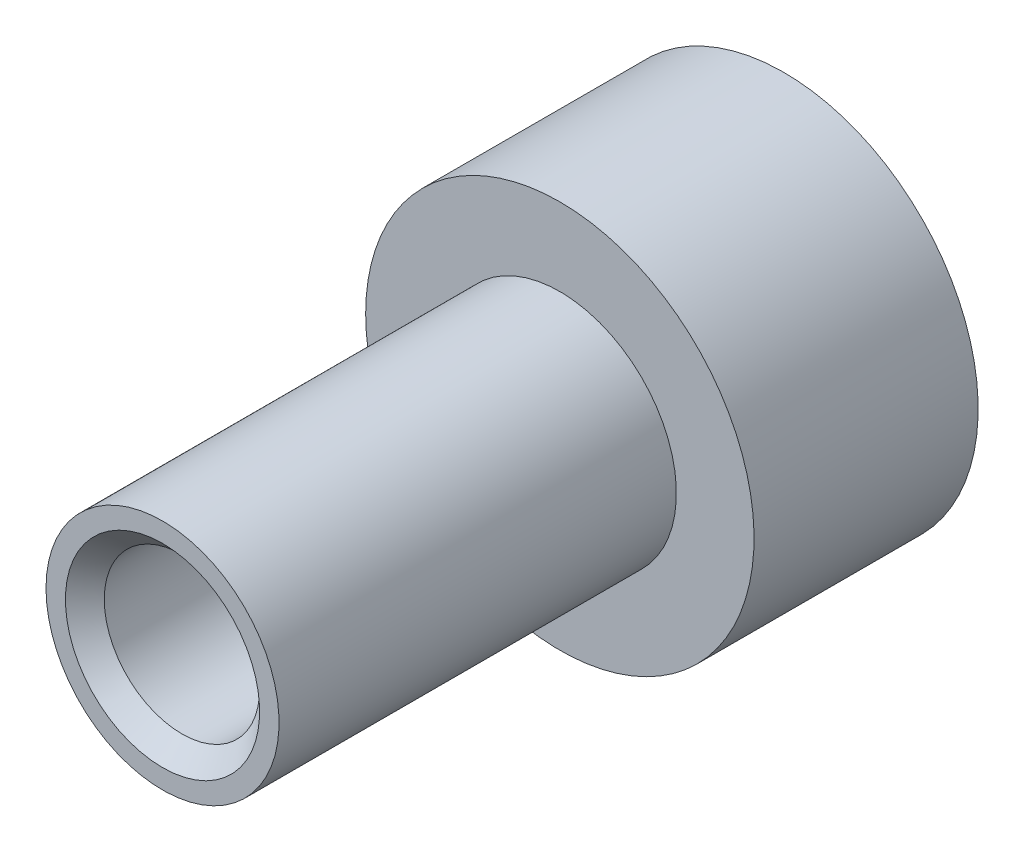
ISO-10303-21;
HEADER;
FILE_DESCRIPTION(('STEP AP214'),'2;1');
FILE_NAME('part.step','',(''),(''),'','','');
FILE_SCHEMA(('AUTOMOTIVE_DESIGN { 1 0 10303 214 1 1 1 1 }'));
ENDSEC;
DATA;
#1=APPLICATION_CONTEXT('core data for automotive mechanical design processes');
#2=APPLICATION_PROTOCOL_DEFINITION('international standard','automotive_design',2000,#1);
#3=PRODUCT_CONTEXT('',#1,'mechanical');
#4=PRODUCT('Part','Part','',(#3));
#5=PRODUCT_RELATED_PRODUCT_CATEGORY('part','',(#4));
#6=PRODUCT_DEFINITION_FORMATION('','',#4);
#7=PRODUCT_DEFINITION_CONTEXT('part definition',#1,'design');
#8=PRODUCT_DEFINITION('design','',#6,#7);
#9=PRODUCT_DEFINITION_SHAPE('','',#8);
#10=(LENGTH_UNIT() NAMED_UNIT(*) SI_UNIT(.MILLI.,.METRE.));
#11=(NAMED_UNIT(*) PLANE_ANGLE_UNIT() SI_UNIT($,.RADIAN.));
#12=(NAMED_UNIT(*) SI_UNIT($,.STERADIAN.) SOLID_ANGLE_UNIT());
#13=UNCERTAINTY_MEASURE_WITH_UNIT(LENGTH_MEASURE(1.E-05),#10,'distance_accuracy_value','');
#14=(GEOMETRIC_REPRESENTATION_CONTEXT(3) GLOBAL_UNCERTAINTY_ASSIGNED_CONTEXT((#13)) GLOBAL_UNIT_ASSIGNED_CONTEXT((#10,
#11,#12)) REPRESENTATION_CONTEXT('',''));
#15=CARTESIAN_POINT('',(0.,0.,0.));
#16=DIRECTION('',(0.,0.,1.));
#17=DIRECTION('',(1.,0.,0.));
#18=AXIS2_PLACEMENT_3D('',#15,#16,#17);
#19=CARTESIAN_POINT('',(-40.729143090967,-59.2950000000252,16.6130545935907));
#20=DIRECTION('',(0.,0.,-1.));
#21=DIRECTION('',(-1.,0.,0.));
#22=AXIS2_PLACEMENT_3D('',#19,#20,#21);
#23=CYLINDRICAL_SURFACE('',#22,2.99999999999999);
#24=CARTESIAN_POINT('',(-40.729143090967,-59.2950000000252,8.1277732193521));
#25=DIRECTION('',(0.,0.,1.));
#26=DIRECTION('',(0.,-1.,0.));
#27=AXIS2_PLACEMENT_3D('',#24,#25,#26);
#28=CIRCLE('',#27,2.99999999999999);
#29=CARTESIAN_POINT('',(-43.729143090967,-59.2950000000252,8.1277732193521));
#30=VERTEX_POINT('',#29);
#31=EDGE_CURVE('E77',#30,#30,#28,.T.);
#32=CARTESIAN_POINT('',(-40.729143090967,-59.2950000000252,-2.1022267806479));
#33=DIRECTION('',(0.,0.,-1.));
#34=DIRECTION('',(0.,1.,0.));
#35=AXIS2_PLACEMENT_3D('',#32,#33,#34);
#36=CIRCLE('',#35,2.99999999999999);
#37=CARTESIAN_POINT('',(-43.729143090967,-59.2950000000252,-2.10222678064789));
#38=VERTEX_POINT('',#37);
#39=EDGE_CURVE('E74',#38,#38,#36,.T.);
#40=CARTESIAN_POINT('',(-43.729143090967,-59.2950000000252,8.1277732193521));
#41=CARTESIAN_POINT('',(-43.729143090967,-59.2950000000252,8.0212107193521));
#42=CARTESIAN_POINT('',(-43.729143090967,-59.2950000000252,7.9146482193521));
#43=CARTESIAN_POINT('',(-43.729143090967,-59.2950000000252,7.7015232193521));
#44=CARTESIAN_POINT('',(-43.729143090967,-59.2950000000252,7.5949607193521));
#45=CARTESIAN_POINT('',(-43.729143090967,-59.2950000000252,7.3818357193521));
#46=CARTESIAN_POINT('',(-43.729143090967,-59.2950000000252,7.2752732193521));
#47=CARTESIAN_POINT('',(-43.729143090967,-59.2950000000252,7.0621482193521));
#48=CARTESIAN_POINT('',(-43.729143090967,-59.2950000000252,6.9555857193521));
#49=CARTESIAN_POINT('',(-43.729143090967,-59.2950000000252,6.7424607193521));
#50=CARTESIAN_POINT('',(-43.729143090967,-59.2950000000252,6.6358982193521));
#51=CARTESIAN_POINT('',(-43.729143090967,-59.2950000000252,6.4227732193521));
#52=CARTESIAN_POINT('',(-43.729143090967,-59.2950000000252,6.3162107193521));
#53=CARTESIAN_POINT('',(-43.729143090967,-59.2950000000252,6.1030857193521));
#54=CARTESIAN_POINT('',(-43.729143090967,-59.2950000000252,5.9965232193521));
#55=CARTESIAN_POINT('',(-43.729143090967,-59.2950000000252,5.7833982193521));
#56=CARTESIAN_POINT('',(-43.729143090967,-59.2950000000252,5.6768357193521));
#57=CARTESIAN_POINT('',(-43.729143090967,-59.2950000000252,5.4637107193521));
#58=CARTESIAN_POINT('',(-43.729143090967,-59.2950000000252,5.3571482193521));
#59=CARTESIAN_POINT('',(-43.729143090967,-59.2950000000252,5.1440232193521));
#60=CARTESIAN_POINT('',(-43.729143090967,-59.2950000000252,5.0374607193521));
#61=CARTESIAN_POINT('',(-43.729143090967,-59.2950000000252,4.8243357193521));
#62=CARTESIAN_POINT('',(-43.729143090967,-59.2950000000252,4.7177732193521));
#63=CARTESIAN_POINT('',(-43.729143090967,-59.2950000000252,4.5046482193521));
#64=CARTESIAN_POINT('',(-43.729143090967,-59.2950000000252,4.3980857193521));
#65=CARTESIAN_POINT('',(-43.729143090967,-59.2950000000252,4.1849607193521));
#66=CARTESIAN_POINT('',(-43.729143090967,-59.2950000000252,4.0783982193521));
#67=CARTESIAN_POINT('',(-43.729143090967,-59.2950000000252,3.8652732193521));
#68=CARTESIAN_POINT('',(-43.729143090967,-59.2950000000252,3.7587107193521));
#69=CARTESIAN_POINT('',(-43.729143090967,-59.2950000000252,3.54558571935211));
#70=CARTESIAN_POINT('',(-43.729143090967,-59.2950000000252,3.43902321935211));
#71=CARTESIAN_POINT('',(-43.729143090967,-59.2950000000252,3.22589821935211));
#72=CARTESIAN_POINT('',(-43.729143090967,-59.2950000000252,3.11933571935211));
#73=CARTESIAN_POINT('',(-43.729143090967,-59.2950000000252,2.90621071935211));
#74=CARTESIAN_POINT('',(-43.729143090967,-59.2950000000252,2.79964821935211));
#75=CARTESIAN_POINT('',(-43.729143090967,-59.2950000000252,2.58652321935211));
#76=CARTESIAN_POINT('',(-43.729143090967,-59.2950000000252,2.47996071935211));
#77=CARTESIAN_POINT('',(-43.729143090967,-59.2950000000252,2.26683571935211));
#78=CARTESIAN_POINT('',(-43.729143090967,-59.2950000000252,2.16027321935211));
#79=CARTESIAN_POINT('',(-43.729143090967,-59.2950000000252,1.94714821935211));
#80=CARTESIAN_POINT('',(-43.729143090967,-59.2950000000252,1.84058571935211));
#81=CARTESIAN_POINT('',(-43.729143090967,-59.2950000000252,1.62746071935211));
#82=CARTESIAN_POINT('',(-43.729143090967,-59.2950000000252,1.52089821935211));
#83=CARTESIAN_POINT('',(-43.729143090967,-59.2950000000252,1.30777321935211));
#84=CARTESIAN_POINT('',(-43.729143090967,-59.2950000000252,1.20121071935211));
#85=CARTESIAN_POINT('',(-43.729143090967,-59.2950000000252,0.988085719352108));
#86=CARTESIAN_POINT('',(-43.729143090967,-59.2950000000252,0.881523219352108));
#87=CARTESIAN_POINT('',(-43.729143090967,-59.2950000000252,0.668398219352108));
#88=CARTESIAN_POINT('',(-43.729143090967,-59.2950000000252,0.561835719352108));
#89=CARTESIAN_POINT('',(-43.729143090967,-59.2950000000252,0.348710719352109));
#90=CARTESIAN_POINT('',(-43.729143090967,-59.2950000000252,0.242148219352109));
#91=CARTESIAN_POINT('',(-43.729143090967,-59.2950000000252,0.0290232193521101));
#92=CARTESIAN_POINT('',(-43.729143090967,-59.2950000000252,-0.0775392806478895));
#93=CARTESIAN_POINT('',(-43.729143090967,-59.2950000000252,-0.290664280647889));
#94=CARTESIAN_POINT('',(-43.729143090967,-59.2950000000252,-0.397226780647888));
#95=CARTESIAN_POINT('',(-43.729143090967,-59.2950000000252,-0.610351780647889));
#96=CARTESIAN_POINT('',(-43.729143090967,-59.2950000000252,-0.716914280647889));
#97=CARTESIAN_POINT('',(-43.729143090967,-59.2950000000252,-0.93003928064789));
#98=CARTESIAN_POINT('',(-43.729143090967,-59.2950000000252,-1.03660178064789));
#99=CARTESIAN_POINT('',(-43.729143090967,-59.2950000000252,-1.24972678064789));
#100=CARTESIAN_POINT('',(-43.729143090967,-59.2950000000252,-1.35628928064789));
#101=CARTESIAN_POINT('',(-43.729143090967,-59.2950000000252,-1.56941428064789));
#102=CARTESIAN_POINT('',(-43.729143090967,-59.2950000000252,-1.67597678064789));
#103=CARTESIAN_POINT('',(-43.729143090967,-59.2950000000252,-1.88910178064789));
#104=CARTESIAN_POINT('',(-43.729143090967,-59.2950000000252,-1.99566428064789));
#105=CARTESIAN_POINT('',(-43.729143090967,-59.2950000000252,-2.10222678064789));
#106=B_SPLINE_CURVE_WITH_KNOTS('',3,(#40,#41,#42,#43,#44,#45,#46,#47,#48,#49,#50,#51,#52,#53,
#54,#55,#56,#57,#58,#59,#60,#61,#62,#63,#64,#65,#66,#67,#68,#69,#70,#71,#72,#73,#74,#75,#76,#77,
#78,#79,#80,#81,#82,#83,#84,#85,#86,#87,#88,#89,#90,#91,#92,#93,#94,#95,#96,#97,#98,#99,#100,
#101,#102,#103,#104,#105),.UNSPECIFIED.,.F.,.F.,(4,2,2,2,2,2,2,2,2,2,2,2,2,2,2,2,2,2,2,2,2,2,2,
2,2,2,2,2,2,2,2,2,4),(0.,0.319687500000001,0.639374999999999,0.9590625,1.27875,1.5984375,
1.918125,2.2378125,2.5575,2.8771875,3.196875,3.5165625,3.83625,4.1559375,4.475625,4.7953125,
5.115,5.4346875,5.754375,6.07406249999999,6.39374999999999,6.7134375,7.03312499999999,
7.35281249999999,7.67249999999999,7.99218749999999,8.31187499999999,8.63156249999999,
8.95124999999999,9.27093749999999,9.59062499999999,9.91031249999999,10.23),.UNSPECIFIED.);
#107=EDGE_CURVE('BSEAM53',#30,#38,#106,.T.);
#108=ORIENTED_EDGE('',*,*,#31,.F.);
#109=ORIENTED_EDGE('',*,*,#39,.F.);
#110=ORIENTED_EDGE('',*,*,#107,.T.);
#111=ORIENTED_EDGE('',*,*,#107,.F.);
#112=EDGE_LOOP('',(#108,#110,#109,#111));
#113=FACE_BOUND('',#112,.T.);
#114=ADVANCED_FACE('F53',(#113),#23,.T.);
#115=CARTESIAN_POINT('',(-40.729143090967,-59.2950000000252,-7.87222678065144));
#116=DIRECTION('',(0.,0.,1.));
#117=DIRECTION('',(1.,0.,0.));
#118=AXIS2_PLACEMENT_3D('',#115,#116,#117);
#119=PLANE('',#118);
#120=CARTESIAN_POINT('',(-40.729143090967,-59.2950000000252,-7.87222678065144));
#121=DIRECTION('',(0.,0.,1.));
#122=DIRECTION('',(1.,0.,0.));
#123=AXIS2_PLACEMENT_3D('',#120,#121,#122);
#124=CIRCLE('',#123,2.5);
#125=CARTESIAN_POINT('',(-38.229143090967,-59.2950000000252,-7.87222678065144));
#126=VERTEX_POINT('',#125);
#127=EDGE_CURVE('E69',#126,#126,#124,.T.);
#128=ORIENTED_EDGE('',*,*,#127,.T.);
#129=EDGE_LOOP('',(#128));
#130=FACE_BOUND('',#129,.T.);
#131=CARTESIAN_POINT('',(-40.729143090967,-59.2950000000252,-7.87222678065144));
#132=DIRECTION('',(0.,0.,-1.));
#133=DIRECTION('',(-1.,0.,0.));
#134=AXIS2_PLACEMENT_3D('',#131,#132,#133);
#135=CIRCLE('',#134,5.00000000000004);
#136=CARTESIAN_POINT('',(-45.729143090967,-59.2950000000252,-7.87222678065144));
#137=VERTEX_POINT('',#136);
#138=EDGE_CURVE('E81',#137,#137,#135,.T.);
#139=ORIENTED_EDGE('',*,*,#138,.T.);
#140=EDGE_LOOP('',(#139));
#141=FACE_BOUND('',#140,.T.);
#142=ADVANCED_FACE('F97',(#130,#141),#119,.F.);
#143=CARTESIAN_POINT('',(-40.729143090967,-59.2950000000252,16.6130545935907));
#144=DIRECTION('',(0.,0.,-1.));
#145=DIRECTION('',(-1.,0.,0.));
#146=AXIS2_PLACEMENT_3D('',#143,#144,#145);
#147=CYLINDRICAL_SURFACE('',#146,2.);
#148=CARTESIAN_POINT('',(-40.729143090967,-59.2950000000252,-7.37222678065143));
#149=DIRECTION('',(0.,0.,1.));
#150=DIRECTION('',(1.,0.,0.));
#151=AXIS2_PLACEMENT_3D('',#148,#149,#150);
#152=CIRCLE('',#151,2.);
#153=CARTESIAN_POINT('',(-42.729143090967,-59.2950000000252,-7.37222678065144));
#154=VERTEX_POINT('',#153);
#155=EDGE_CURVE('E61',#154,#154,#152,.F.);
#156=CARTESIAN_POINT('',(-40.729143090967,-59.2950000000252,7.6277732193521));
#157=DIRECTION('',(0.,0.,1.));
#158=DIRECTION('',(1.,0.,0.));
#159=AXIS2_PLACEMENT_3D('',#156,#157,#158);
#160=CIRCLE('',#159,2.);
#161=CARTESIAN_POINT('',(-42.729143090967,-59.2950000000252,7.6277732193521));
#162=VERTEX_POINT('',#161);
#163=EDGE_CURVE('E65',#162,#162,#160,.T.);
#164=CARTESIAN_POINT('',(-42.729143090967,-59.2950000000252,-7.37222678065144));
#165=CARTESIAN_POINT('',(-42.729143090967,-59.2950000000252,-7.2159767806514));
#166=CARTESIAN_POINT('',(-42.729143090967,-59.2950000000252,-7.05972678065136));
#167=CARTESIAN_POINT('',(-42.729143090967,-59.2950000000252,-6.74722678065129));
#168=CARTESIAN_POINT('',(-42.729143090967,-59.2950000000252,-6.59097678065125));
#169=CARTESIAN_POINT('',(-42.729143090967,-59.2950000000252,-6.27847678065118));
#170=CARTESIAN_POINT('',(-42.729143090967,-59.2950000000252,-6.12222678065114));
#171=CARTESIAN_POINT('',(-42.729143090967,-59.2950000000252,-5.80972678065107));
#172=CARTESIAN_POINT('',(-42.729143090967,-59.2950000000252,-5.65347678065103));
#173=CARTESIAN_POINT('',(-42.729143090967,-59.2950000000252,-5.34097678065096));
#174=CARTESIAN_POINT('',(-42.729143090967,-59.2950000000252,-5.18472678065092));
#175=CARTESIAN_POINT('',(-42.729143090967,-59.2950000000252,-4.87222678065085));
#176=CARTESIAN_POINT('',(-42.729143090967,-59.2950000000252,-4.71597678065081));
#177=CARTESIAN_POINT('',(-42.729143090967,-59.2950000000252,-4.40347678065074));
#178=CARTESIAN_POINT('',(-42.729143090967,-59.2950000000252,-4.2472267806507));
#179=CARTESIAN_POINT('',(-42.729143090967,-59.2950000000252,-3.93472678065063));
#180=CARTESIAN_POINT('',(-42.729143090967,-59.2950000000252,-3.77847678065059));
#181=CARTESIAN_POINT('',(-42.729143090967,-59.2950000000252,-3.46597678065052));
#182=CARTESIAN_POINT('',(-42.729143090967,-59.2950000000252,-3.30972678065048));
#183=CARTESIAN_POINT('',(-42.729143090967,-59.2950000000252,-2.99722678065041));
#184=CARTESIAN_POINT('',(-42.729143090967,-59.2950000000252,-2.84097678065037));
#185=CARTESIAN_POINT('',(-42.729143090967,-59.2950000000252,-2.5284767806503));
#186=CARTESIAN_POINT('',(-42.729143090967,-59.2950000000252,-2.37222678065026));
#187=CARTESIAN_POINT('',(-42.729143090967,-59.2950000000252,-2.05972678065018));
#188=CARTESIAN_POINT('',(-42.729143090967,-59.2950000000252,-1.90347678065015));
#189=CARTESIAN_POINT('',(-42.729143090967,-59.2950000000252,-1.59097678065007));
#190=CARTESIAN_POINT('',(-42.729143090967,-59.2950000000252,-1.43472678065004));
#191=CARTESIAN_POINT('',(-42.729143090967,-59.2950000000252,-1.12222678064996));
#192=CARTESIAN_POINT('',(-42.729143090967,-59.2950000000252,-0.965976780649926));
#193=CARTESIAN_POINT('',(-42.729143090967,-59.2950000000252,-0.653476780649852));
#194=CARTESIAN_POINT('',(-42.729143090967,-59.2950000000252,-0.497226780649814));
#195=CARTESIAN_POINT('',(-42.729143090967,-59.2950000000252,-0.184726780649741));
#196=CARTESIAN_POINT('',(-42.729143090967,-59.2950000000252,-0.0284767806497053));
#197=CARTESIAN_POINT('',(-42.729143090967,-59.2950000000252,0.284023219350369));
#198=CARTESIAN_POINT('',(-42.729143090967,-59.2950000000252,0.440273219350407));
#199=CARTESIAN_POINT('',(-42.729143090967,-59.2950000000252,0.752773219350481));
#200=CARTESIAN_POINT('',(-42.729143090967,-59.2950000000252,0.909023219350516));
#201=CARTESIAN_POINT('',(-42.729143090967,-59.2950000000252,1.22152321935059));
#202=CARTESIAN_POINT('',(-42.729143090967,-59.2950000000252,1.37777321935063));
#203=CARTESIAN_POINT('',(-42.729143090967,-59.2950000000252,1.6902732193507));
#204=CARTESIAN_POINT('',(-42.729143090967,-59.2950000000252,1.84652321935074));
#205=CARTESIAN_POINT('',(-42.729143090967,-59.2950000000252,2.15902321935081));
#206=CARTESIAN_POINT('',(-42.729143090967,-59.2950000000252,2.31527321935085));
#207=CARTESIAN_POINT('',(-42.729143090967,-59.2950000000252,2.62777321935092));
#208=CARTESIAN_POINT('',(-42.729143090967,-59.2950000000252,2.78402321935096));
#209=CARTESIAN_POINT('',(-42.729143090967,-59.2950000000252,3.09652321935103));
#210=CARTESIAN_POINT('',(-42.729143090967,-59.2950000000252,3.25277321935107));
#211=CARTESIAN_POINT('',(-42.729143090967,-59.2950000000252,3.56527321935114));
#212=CARTESIAN_POINT('',(-42.729143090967,-59.2950000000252,3.72152321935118));
#213=CARTESIAN_POINT('',(-42.729143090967,-59.2950000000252,4.03402321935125));
#214=CARTESIAN_POINT('',(-42.729143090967,-59.2950000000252,4.19027321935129));
#215=CARTESIAN_POINT('',(-42.729143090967,-59.2950000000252,4.50277321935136));
#216=CARTESIAN_POINT('',(-42.729143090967,-59.2950000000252,4.6590232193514));
#217=CARTESIAN_POINT('',(-42.729143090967,-59.2950000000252,4.97152321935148));
#218=CARTESIAN_POINT('',(-42.729143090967,-59.2950000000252,5.12777321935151));
#219=CARTESIAN_POINT('',(-42.729143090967,-59.2950000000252,5.44027321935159));
#220=CARTESIAN_POINT('',(-42.729143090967,-59.2950000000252,5.59652321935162));
#221=CARTESIAN_POINT('',(-42.729143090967,-59.2950000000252,5.9090232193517));
#222=CARTESIAN_POINT('',(-42.729143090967,-59.2950000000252,6.06527321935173));
#223=CARTESIAN_POINT('',(-42.729143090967,-59.2950000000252,6.37777321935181));
#224=CARTESIAN_POINT('',(-42.729143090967,-59.2950000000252,6.53402321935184));
#225=CARTESIAN_POINT('',(-42.729143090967,-59.2950000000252,6.84652321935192));
#226=CARTESIAN_POINT('',(-42.729143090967,-59.2950000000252,7.00277321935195));
#227=CARTESIAN_POINT('',(-42.729143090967,-59.2950000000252,7.31527321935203));
#228=CARTESIAN_POINT('',(-42.729143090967,-59.2950000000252,7.47152321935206));
#229=CARTESIAN_POINT('',(-42.729143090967,-59.2950000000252,7.6277732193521));
#230=B_SPLINE_CURVE_WITH_KNOTS('',3,(#164,#165,#166,#167,#168,#169,#170,#171,#172,#173,#174,
#175,#176,#177,#178,#179,#180,#181,#182,#183,#184,#185,#186,#187,#188,#189,#190,#191,#192,#193,
#194,#195,#196,#197,#198,#199,#200,#201,#202,#203,#204,#205,#206,#207,#208,#209,#210,#211,#212,
#213,#214,#215,#216,#217,#218,#219,#220,#221,#222,#223,#224,#225,#226,#227,#228,#229),
.UNSPECIFIED.,.F.,.F.,(4,2,2,2,2,2,2,2,2,2,2,2,2,2,2,2,2,2,2,2,2,2,2,2,2,2,2,2,2,2,2,2,4),(0.,
0.468750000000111,0.937500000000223,1.40625000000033,1.87500000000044,2.34375000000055,
2.81250000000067,3.28125000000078,3.75000000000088,4.218750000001,4.68750000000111,
5.15625000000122,5.62500000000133,6.09375000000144,6.56250000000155,7.03125000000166,
7.50000000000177,7.96875000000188,8.43750000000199,8.9062500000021,9.37500000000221,
9.84375000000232,10.3125000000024,10.7812500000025,11.2500000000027,11.7187500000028,
12.1875000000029,12.656250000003,13.1250000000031,13.5937500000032,14.0625000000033,
14.5312500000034,15.0000000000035),.UNSPECIFIED.);
#231=EDGE_CURVE('BSEAM99',#154,#162,#230,.T.);
#232=ORIENTED_EDGE('',*,*,#155,.T.);
#233=ORIENTED_EDGE('',*,*,#163,.T.);
#234=ORIENTED_EDGE('',*,*,#231,.T.);
#235=ORIENTED_EDGE('',*,*,#231,.F.);
#236=EDGE_LOOP('',(#232,#234,#233,#235));
#237=FACE_BOUND('',#236,.T.);
#238=ADVANCED_FACE('F99',(#237),#147,.F.);
#239=CARTESIAN_POINT('',(-36.9301731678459,-59.3834732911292,8.1277732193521));
#240=DIRECTION('',(0.,0.,1.));
#241=DIRECTION('',(0.479701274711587,-0.877431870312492,0.));
#242=AXIS2_PLACEMENT_3D('',#239,#240,#241);
#243=PLANE('',#242);
#244=CARTESIAN_POINT('',(-40.729143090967,-59.2950000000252,8.1277732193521));
#245=DIRECTION('',(0.,0.,1.));
#246=DIRECTION('',(0.,-1.,0.));
#247=AXIS2_PLACEMENT_3D('',#244,#245,#246);
#248=CIRCLE('',#247,2.5);
#249=CARTESIAN_POINT('',(-40.729143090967,-61.7950000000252,8.1277732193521));
#250=VERTEX_POINT('',#249);
#251=EDGE_CURVE('E11',#250,#250,#248,.F.);
#252=ORIENTED_EDGE('',*,*,#251,.T.);
#253=EDGE_LOOP('',(#252));
#254=FACE_BOUND('',#253,.T.);
#255=ORIENTED_EDGE('',*,*,#31,.T.);
#256=EDGE_LOOP('',(#255));
#257=FACE_BOUND('',#256,.T.);
#258=ADVANCED_FACE('F93',(#254,#257),#243,.T.);
#259=CARTESIAN_POINT('',(-40.729143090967,-59.2950000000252,12.0399088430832));
#260=DIRECTION('',(0.,0.,-1.));
#261=DIRECTION('',(-1.,0.,0.));
#262=AXIS2_PLACEMENT_3D('',#259,#260,#261);
#263=CYLINDRICAL_SURFACE('',#262,5.00000000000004);
#264=CARTESIAN_POINT('',(-40.729143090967,-59.2950000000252,-2.1022267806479));
#265=DIRECTION('',(0.,0.,-1.));
#266=DIRECTION('',(0.,1.,0.));
#267=AXIS2_PLACEMENT_3D('',#264,#265,#266);
#268=CIRCLE('',#267,5.00000000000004);
#269=CARTESIAN_POINT('',(-40.729143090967,-54.2950000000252,-2.10222678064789));
#270=VERTEX_POINT('',#269);
#271=EDGE_CURVE('E80',#270,#270,#268,.F.);
#272=ORIENTED_EDGE('',*,*,#271,.F.);
#273=EDGE_LOOP('',(#272));
#274=FACE_BOUND('',#273,.T.);
#275=ORIENTED_EDGE('',*,*,#138,.F.);
#276=EDGE_LOOP('',(#275));
#277=FACE_BOUND('',#276,.T.);
#278=ADVANCED_FACE('F90',(#274,#277),#263,.T.);
#279=CARTESIAN_POINT('',(-40.7291430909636,-59.295000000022,-2.1022267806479));
#280=DIRECTION('',(0.,0.,-1.));
#281=DIRECTION('',(0.980497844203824,-0.196529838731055,0.));
#282=AXIS2_PLACEMENT_3D('',#279,#280,#281);
#283=PLANE('',#282);
#284=ORIENTED_EDGE('',*,*,#271,.T.);
#285=EDGE_LOOP('',(#284));
#286=FACE_BOUND('',#285,.T.);
#287=ORIENTED_EDGE('',*,*,#39,.T.);
#288=EDGE_LOOP('',(#287));
#289=FACE_BOUND('',#288,.T.);
#290=ADVANCED_FACE('F87',(#286,#289),#283,.F.);
#291=CARTESIAN_POINT('',(-40.729143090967,-59.2950000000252,-7.87222678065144));
#292=DIRECTION('',(0.,0.,-1.));
#293=DIRECTION('',(-1.,0.,0.));
#294=AXIS2_PLACEMENT_3D('',#291,#292,#293);
#295=CONICAL_SURFACE('',#294,2.5,0.78539816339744);
#296=ORIENTED_EDGE('',*,*,#155,.F.);
#297=EDGE_LOOP('',(#296));
#298=FACE_BOUND('',#297,.T.);
#299=ORIENTED_EDGE('',*,*,#127,.F.);
#300=EDGE_LOOP('',(#299));
#301=FACE_BOUND('',#300,.T.);
#302=ADVANCED_FACE('F112',(#298,#301),#295,.F.);
#303=CARTESIAN_POINT('',(-40.729143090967,-59.2950000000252,7.6277732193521));
#304=DIRECTION('',(0.,0.,1.));
#305=DIRECTION('',(1.,0.,0.));
#306=AXIS2_PLACEMENT_3D('',#303,#304,#305);
#307=CONICAL_SURFACE('',#306,2.,0.785398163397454);
#308=ORIENTED_EDGE('',*,*,#251,.F.);
#309=EDGE_LOOP('',(#308));
#310=FACE_BOUND('',#309,.T.);
#311=ORIENTED_EDGE('',*,*,#163,.F.);
#312=EDGE_LOOP('',(#311));
#313=FACE_BOUND('',#312,.T.);
#314=ADVANCED_FACE('F56',(#310,#313),#307,.F.);
#315=CLOSED_SHELL('',(#114,#142,#238,#258,#278,#290,#302,#314));
#316=MANIFOLD_SOLID_BREP('B2',#315);
#317=ADVANCED_BREP_SHAPE_REPRESENTATION('',(#18,#316),#14);
#318=SHAPE_DEFINITION_REPRESENTATION(#9,#317);
ENDSEC;
END-ISO-10303-21;
